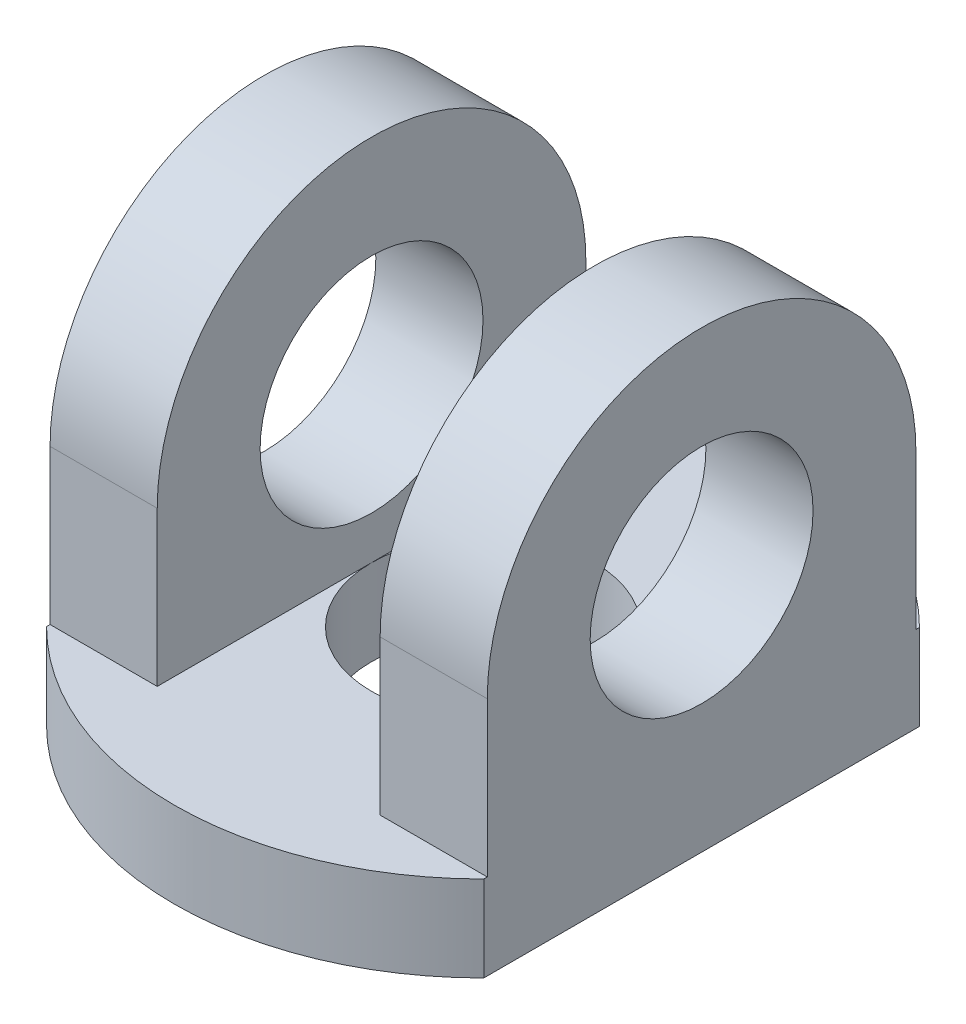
ISO-10303-21;
HEADER;
FILE_DESCRIPTION(('STEP AP214'),'2;1');
FILE_NAME('part.step','',(''),(''),'','','');
FILE_SCHEMA(('AUTOMOTIVE_DESIGN { 1 0 10303 214 1 1 1 1 }'));
ENDSEC;
DATA;
#1=APPLICATION_CONTEXT('core data for automotive mechanical design processes');
#2=APPLICATION_PROTOCOL_DEFINITION('international standard','automotive_design',2000,#1);
#3=PRODUCT_CONTEXT('',#1,'mechanical');
#4=PRODUCT('Part','Part','',(#3));
#5=PRODUCT_RELATED_PRODUCT_CATEGORY('part','',(#4));
#6=PRODUCT_DEFINITION_FORMATION('','',#4);
#7=PRODUCT_DEFINITION_CONTEXT('part definition',#1,'design');
#8=PRODUCT_DEFINITION('design','',#6,#7);
#9=PRODUCT_DEFINITION_SHAPE('','',#8);
#10=(LENGTH_UNIT() NAMED_UNIT(*) SI_UNIT(.MILLI.,.METRE.));
#11=(NAMED_UNIT(*) PLANE_ANGLE_UNIT() SI_UNIT($,.RADIAN.));
#12=(NAMED_UNIT(*) SI_UNIT($,.STERADIAN.) SOLID_ANGLE_UNIT());
#13=UNCERTAINTY_MEASURE_WITH_UNIT(LENGTH_MEASURE(1.E-05),#10,'distance_accuracy_value','');
#14=(GEOMETRIC_REPRESENTATION_CONTEXT(3) GLOBAL_UNCERTAINTY_ASSIGNED_CONTEXT((#13)) GLOBAL_UNIT_ASSIGNED_CONTEXT((#10,
#11,#12)) REPRESENTATION_CONTEXT('',''));
#15=CARTESIAN_POINT('',(0.,0.,0.));
#16=DIRECTION('',(0.,0.,1.));
#17=DIRECTION('',(1.,0.,0.));
#18=AXIS2_PLACEMENT_3D('',#15,#16,#17);
#19=CARTESIAN_POINT('',(0.,20.,0.));
#20=DIRECTION('',(0.,1.,0.));
#21=DIRECTION('',(0.,0.,1.));
#22=AXIS2_PLACEMENT_3D('',#19,#20,#21);
#23=PLANE('',#22);
#24=DIRECTION('',(0.,0.,1.));
#25=VECTOR('',#24,1.);
#26=CARTESIAN_POINT('',(51.,20.,-50.));
#27=LINE('',#26,#25);
#28=CARTESIAN_POINT('',(51.,20.,-50.8232230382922));
#29=VERTEX_POINT('',#28);
#30=CARTESIAN_POINT('',(51.,20.,-50.));
#31=VERTEX_POINT('',#30);
#32=EDGE_CURVE('E131',#29,#31,#27,.T.);
#33=ORIENTED_EDGE('',*,*,#32,.F.);
#34=CARTESIAN_POINT('',(0.,20.,0.));
#35=DIRECTION('',(0.,1.,0.));
#36=DIRECTION('',(0.,0.,1.));
#37=AXIS2_PLACEMENT_3D('',#34,#35,#36);
#38=CIRCLE('',#37,72.);
#39=CARTESIAN_POINT('',(-51.,20.,-50.8232230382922));
#40=VERTEX_POINT('',#39);
#41=EDGE_CURVE('E138',#29,#40,#38,.T.);
#42=ORIENTED_EDGE('',*,*,#41,.T.);
#43=DIRECTION('',(0.,0.,-1.));
#44=VECTOR('',#43,1.);
#45=CARTESIAN_POINT('',(-51.,20.,-50.));
#46=LINE('',#45,#44);
#47=CARTESIAN_POINT('',(-51.,20.,-50.));
#48=VERTEX_POINT('',#47);
#49=EDGE_CURVE('E135',#48,#40,#46,.T.);
#50=ORIENTED_EDGE('',*,*,#49,.F.);
#51=DIRECTION('',(1.,0.,0.));
#52=VECTOR('',#51,1.);
#53=CARTESIAN_POINT('',(-51.,20.,-50.));
#54=LINE('',#53,#52);
#55=CARTESIAN_POINT('',(-26.,20.,-50.));
#56=VERTEX_POINT('',#55);
#57=EDGE_CURVE('E238',#48,#56,#54,.T.);
#58=ORIENTED_EDGE('',*,*,#57,.T.);
#59=DIRECTION('',(0.,0.,1.));
#60=VECTOR('',#59,1.);
#61=CARTESIAN_POINT('',(-26.,20.,-72.));
#62=LINE('',#61,#60);
#63=CARTESIAN_POINT('',(-26.,20.,0.));
#64=VERTEX_POINT('',#63);
#65=EDGE_CURVE('E203',#56,#64,#62,.T.);
#66=ORIENTED_EDGE('',*,*,#65,.T.);
#67=CARTESIAN_POINT('',(0.,20.,0.));
#68=DIRECTION('',(0.,1.,0.));
#69=DIRECTION('',(0.,0.,1.));
#70=AXIS2_PLACEMENT_3D('',#67,#68,#69);
#71=CIRCLE('',#70,26.);
#72=CARTESIAN_POINT('',(26.,20.,0.));
#73=VERTEX_POINT('',#72);
#74=EDGE_CURVE('E45',#73,#64,#71,.T.);
#75=ORIENTED_EDGE('',*,*,#74,.F.);
#76=DIRECTION('',(0.,0.,1.));
#77=VECTOR('',#76,1.);
#78=CARTESIAN_POINT('',(26.,20.,-72.));
#79=LINE('',#78,#77);
#80=CARTESIAN_POINT('',(26.,20.,-50.));
#81=VERTEX_POINT('',#80);
#82=EDGE_CURVE('E52',#81,#73,#79,.T.);
#83=ORIENTED_EDGE('',*,*,#82,.F.);
#84=EDGE_CURVE('E141',#81,#31,#54,.T.);
#85=ORIENTED_EDGE('',*,*,#84,.T.);
#86=EDGE_LOOP('',(#33,#42,#50,#58,#66,#75,#83,#85));
#87=FACE_BOUND('',#86,.T.);
#88=ADVANCED_FACE('F31',(#87),#23,.T.);
#89=CARTESIAN_POINT('',(0.,20.,0.));
#90=DIRECTION('',(0.,-1.,0.));
#91=DIRECTION('',(0.,0.,-1.));
#92=AXIS2_PLACEMENT_3D('',#89,#90,#91);
#93=CYLINDRICAL_SURFACE('',#92,72.);
#94=ORIENTED_EDGE('',*,*,#41,.F.);
#95=DIRECTION('',(0.,-1.,0.));
#96=VECTOR('',#95,1.);
#97=CARTESIAN_POINT('',(51.,20.,-50.8232230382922));
#98=LINE('',#97,#96);
#99=CARTESIAN_POINT('',(51.,0.,-50.8232230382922));
#100=VERTEX_POINT('',#99);
#101=EDGE_CURVE('E126',#29,#100,#98,.T.);
#102=ORIENTED_EDGE('',*,*,#101,.T.);
#103=CARTESIAN_POINT('',(0.,0.,0.));
#104=DIRECTION('',(0.,1.,0.));
#105=DIRECTION('',(0.,0.,1.));
#106=AXIS2_PLACEMENT_3D('',#103,#104,#105);
#107=CIRCLE('',#106,72.);
#108=CARTESIAN_POINT('',(-51.,0.,-50.8232230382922));
#109=VERTEX_POINT('',#108);
#110=EDGE_CURVE('E155',#100,#109,#107,.T.);
#111=ORIENTED_EDGE('',*,*,#110,.T.);
#112=DIRECTION('',(0.,-1.,0.));
#113=VECTOR('',#112,1.);
#114=CARTESIAN_POINT('',(-51.,20.,-50.8232230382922));
#115=LINE('',#114,#113);
#116=EDGE_CURVE('E148',#109,#40,#115,.F.);
#117=ORIENTED_EDGE('',*,*,#116,.T.);
#118=EDGE_LOOP('',(#94,#102,#111,#117));
#119=FACE_BOUND('',#118,.T.);
#120=ADVANCED_FACE('F146',(#119),#93,.T.);
#121=CARTESIAN_POINT('',(-51.,20.,50.));
#122=DIRECTION('',(0.,0.,1.));
#123=DIRECTION('',(1.,0.,0.));
#124=AXIS2_PLACEMENT_3D('',#121,#122,#123);
#125=PLANE('',#124);
#126=DIRECTION('',(0.,-1.,0.));
#127=VECTOR('',#126,1.);
#128=CARTESIAN_POINT('',(-26.,20.,50.));
#129=LINE('',#128,#127);
#130=CARTESIAN_POINT('',(-26.,56.,50.));
#131=VERTEX_POINT('',#130);
#132=CARTESIAN_POINT('',(-26.,20.,50.));
#133=VERTEX_POINT('',#132);
#134=EDGE_CURVE('E211',#131,#133,#129,.T.);
#135=ORIENTED_EDGE('',*,*,#134,.F.);
#136=DIRECTION('',(1.,0.,0.));
#137=VECTOR('',#136,1.);
#138=CARTESIAN_POINT('',(-51.,56.,50.));
#139=LINE('',#138,#137);
#140=CARTESIAN_POINT('',(-51.,56.,50.));
#141=VERTEX_POINT('',#140);
#142=EDGE_CURVE('E231',#141,#131,#139,.T.);
#143=ORIENTED_EDGE('',*,*,#142,.F.);
#144=DIRECTION('',(0.,-1.,0.));
#145=VECTOR('',#144,1.);
#146=CARTESIAN_POINT('',(-51.,20.,50.));
#147=LINE('',#146,#145);
#148=CARTESIAN_POINT('',(-51.,20.,50.));
#149=VERTEX_POINT('',#148);
#150=EDGE_CURVE('E221',#141,#149,#147,.T.);
#151=ORIENTED_EDGE('',*,*,#150,.T.);
#152=DIRECTION('',(1.,0.,0.));
#153=VECTOR('',#152,1.);
#154=CARTESIAN_POINT('',(-51.,20.,50.));
#155=LINE('',#154,#153);
#156=EDGE_CURVE('E158',#149,#133,#155,.T.);
#157=ORIENTED_EDGE('',*,*,#156,.T.);
#158=EDGE_LOOP('',(#135,#143,#151,#157));
#159=FACE_BOUND('',#158,.T.);
#160=ADVANCED_FACE('F284',(#159),#125,.T.);
#161=CARTESIAN_POINT('',(-51.,56.,0.));
#162=DIRECTION('',(1.,0.,0.));
#163=DIRECTION('',(0.,0.,-1.));
#164=AXIS2_PLACEMENT_3D('',#161,#162,#163);
#165=CYLINDRICAL_SURFACE('',#164,50.);
#166=CARTESIAN_POINT('',(-26.,56.,0.));
#167=DIRECTION('',(-1.,0.,0.));
#168=DIRECTION('',(0.,-1.,0.));
#169=AXIS2_PLACEMENT_3D('',#166,#167,#168);
#170=CIRCLE('',#169,50.);
#171=CARTESIAN_POINT('',(-26.,56.,-50.));
#172=VERTEX_POINT('',#171);
#173=EDGE_CURVE('E209',#172,#131,#170,.F.);
#174=ORIENTED_EDGE('',*,*,#173,.F.);
#175=DIRECTION('',(1.,0.,0.));
#176=VECTOR('',#175,1.);
#177=CARTESIAN_POINT('',(-51.,56.,-50.));
#178=LINE('',#177,#176);
#179=CARTESIAN_POINT('',(-51.,56.,-50.));
#180=VERTEX_POINT('',#179);
#181=EDGE_CURVE('E235',#180,#172,#178,.T.);
#182=ORIENTED_EDGE('',*,*,#181,.F.);
#183=CARTESIAN_POINT('',(-51.,56.,0.));
#184=DIRECTION('',(1.,0.,0.));
#185=DIRECTION('',(0.,0.,-1.));
#186=AXIS2_PLACEMENT_3D('',#183,#184,#185);
#187=CIRCLE('',#186,50.);
#188=EDGE_CURVE('E227',#180,#141,#187,.T.);
#189=ORIENTED_EDGE('',*,*,#188,.T.);
#190=ORIENTED_EDGE('',*,*,#142,.T.);
#191=EDGE_LOOP('',(#174,#182,#189,#190));
#192=FACE_BOUND('',#191,.T.);
#193=ADVANCED_FACE('F274',(#192),#165,.T.);
#194=CARTESIAN_POINT('',(-51.,20.,-50.));
#195=DIRECTION('',(0.,0.,-1.));
#196=DIRECTION('',(-1.,0.,0.));
#197=AXIS2_PLACEMENT_3D('',#194,#195,#196);
#198=PLANE('',#197);
#199=DIRECTION('',(0.,1.,0.));
#200=VECTOR('',#199,1.);
#201=CARTESIAN_POINT('',(-26.,20.,-50.));
#202=LINE('',#201,#200);
#203=EDGE_CURVE('E162',#56,#172,#202,.T.);
#204=ORIENTED_EDGE('',*,*,#203,.F.);
#205=ORIENTED_EDGE('',*,*,#57,.F.);
#206=DIRECTION('',(0.,1.,0.));
#207=VECTOR('',#206,1.);
#208=CARTESIAN_POINT('',(-51.,20.,-50.));
#209=LINE('',#208,#207);
#210=EDGE_CURVE('E224',#48,#180,#209,.T.);
#211=ORIENTED_EDGE('',*,*,#210,.T.);
#212=ORIENTED_EDGE('',*,*,#181,.T.);
#213=EDGE_LOOP('',(#204,#205,#211,#212));
#214=FACE_BOUND('',#213,.T.);
#215=ADVANCED_FACE('F266',(#214),#198,.T.);
#216=CARTESIAN_POINT('',(51.,20.,50.));
#217=VERTEX_POINT('',#216);
#218=CARTESIAN_POINT('',(51.,20.,50.8232230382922));
#219=VERTEX_POINT('',#218);
#220=EDGE_CURVE('E143',#217,#219,#27,.T.);
#221=ORIENTED_EDGE('',*,*,#220,.F.);
#222=CARTESIAN_POINT('',(26.,20.,50.));
#223=VERTEX_POINT('',#222);
#224=EDGE_CURVE('E230',#223,#217,#155,.T.);
#225=ORIENTED_EDGE('',*,*,#224,.F.);
#226=EDGE_CURVE('E202',#73,#223,#79,.T.);
#227=ORIENTED_EDGE('',*,*,#226,.F.);
#228=EDGE_CURVE('E185',#64,#73,#71,.T.);
#229=ORIENTED_EDGE('',*,*,#228,.F.);
#230=EDGE_CURVE('E199',#64,#133,#62,.T.);
#231=ORIENTED_EDGE('',*,*,#230,.T.);
#232=ORIENTED_EDGE('',*,*,#156,.F.);
#233=CARTESIAN_POINT('',(-51.,20.,50.8232230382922));
#234=VERTEX_POINT('',#233);
#235=EDGE_CURVE('E188',#234,#149,#46,.T.);
#236=ORIENTED_EDGE('',*,*,#235,.F.);
#237=EDGE_CURVE('E149',#234,#219,#38,.T.);
#238=ORIENTED_EDGE('',*,*,#237,.T.);
#239=EDGE_LOOP('',(#221,#225,#227,#229,#231,#232,#236,#238));
#240=FACE_BOUND('',#239,.T.);
#241=ADVANCED_FACE('F277',(#240),#23,.T.);
#242=CARTESIAN_POINT('',(-51.,0.,50.8232230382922));
#243=VERTEX_POINT('',#242);
#244=CARTESIAN_POINT('',(51.,0.,50.8232230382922));
#245=VERTEX_POINT('',#244);
#246=EDGE_CURVE('E150',#243,#245,#107,.T.);
#247=ORIENTED_EDGE('',*,*,#246,.T.);
#248=DIRECTION('',(0.,-1.,0.));
#249=VECTOR('',#248,1.);
#250=CARTESIAN_POINT('',(51.,20.,50.8232230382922));
#251=LINE('',#250,#249);
#252=EDGE_CURVE('E136',#245,#219,#251,.F.);
#253=ORIENTED_EDGE('',*,*,#252,.T.);
#254=ORIENTED_EDGE('',*,*,#237,.F.);
#255=DIRECTION('',(0.,-1.,0.));
#256=VECTOR('',#255,1.);
#257=CARTESIAN_POINT('',(-51.,20.,50.8232230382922));
#258=LINE('',#257,#256);
#259=EDGE_CURVE('E180',#234,#243,#258,.T.);
#260=ORIENTED_EDGE('',*,*,#259,.T.);
#261=EDGE_LOOP('',(#247,#253,#254,#260));
#262=FACE_BOUND('',#261,.T.);
#263=ADVANCED_FACE('F33',(#262),#93,.T.);
#264=CARTESIAN_POINT('',(0.,0.,0.));
#265=DIRECTION('',(0.,1.,0.));
#266=DIRECTION('',(0.,0.,1.));
#267=AXIS2_PLACEMENT_3D('',#264,#265,#266);
#268=PLANE('',#267);
#269=CARTESIAN_POINT('',(0.,0.,0.));
#270=DIRECTION('',(0.,1.,0.));
#271=DIRECTION('',(0.,0.,1.));
#272=AXIS2_PLACEMENT_3D('',#269,#270,#271);
#273=CIRCLE('',#272,26.);
#274=CARTESIAN_POINT('',(0.,0.,26.));
#275=VERTEX_POINT('',#274);
#276=EDGE_CURVE('E170',#275,#275,#273,.T.);
#277=ORIENTED_EDGE('',*,*,#276,.T.);
#278=EDGE_LOOP('',(#277));
#279=FACE_BOUND('',#278,.T.);
#280=ORIENTED_EDGE('',*,*,#110,.F.);
#281=DIRECTION('',(0.,0.,1.));
#282=VECTOR('',#281,1.);
#283=CARTESIAN_POINT('',(51.,0.,0.));
#284=LINE('',#283,#282);
#285=EDGE_CURVE('E11',#100,#245,#284,.T.);
#286=ORIENTED_EDGE('',*,*,#285,.T.);
#287=ORIENTED_EDGE('',*,*,#246,.F.);
#288=DIRECTION('',(0.,0.,-1.));
#289=VECTOR('',#288,1.);
#290=CARTESIAN_POINT('',(-51.,0.,0.));
#291=LINE('',#290,#289);
#292=EDGE_CURVE('E39',#243,#109,#291,.T.);
#293=ORIENTED_EDGE('',*,*,#292,.T.);
#294=EDGE_LOOP('',(#280,#286,#287,#293));
#295=FACE_BOUND('',#294,.T.);
#296=ADVANCED_FACE('F175',(#279,#295),#268,.F.);
#297=DIRECTION('',(0.,1.,0.));
#298=VECTOR('',#297,1.);
#299=CARTESIAN_POINT('',(26.,20.,50.));
#300=LINE('',#299,#298);
#301=CARTESIAN_POINT('',(26.,56.,50.));
#302=VERTEX_POINT('',#301);
#303=EDGE_CURVE('E207',#223,#302,#300,.T.);
#304=ORIENTED_EDGE('',*,*,#303,.F.);
#305=ORIENTED_EDGE('',*,*,#224,.T.);
#306=DIRECTION('',(0.,-1.,0.));
#307=VECTOR('',#306,1.);
#308=CARTESIAN_POINT('',(51.,20.,50.));
#309=LINE('',#308,#307);
#310=CARTESIAN_POINT('',(51.,56.,50.));
#311=VERTEX_POINT('',#310);
#312=EDGE_CURVE('E214',#311,#217,#309,.T.);
#313=ORIENTED_EDGE('',*,*,#312,.F.);
#314=EDGE_CURVE('E234',#302,#311,#139,.T.);
#315=ORIENTED_EDGE('',*,*,#314,.F.);
#316=EDGE_LOOP('',(#304,#305,#313,#315));
#317=FACE_BOUND('',#316,.T.);
#318=ADVANCED_FACE('F250',(#317),#125,.T.);
#319=CARTESIAN_POINT('',(26.,56.,-50.));
#320=VERTEX_POINT('',#319);
#321=CARTESIAN_POINT('',(51.,56.,-50.));
#322=VERTEX_POINT('',#321);
#323=EDGE_CURVE('E237',#320,#322,#178,.T.);
#324=ORIENTED_EDGE('',*,*,#323,.F.);
#325=CARTESIAN_POINT('',(26.,56.,0.));
#326=DIRECTION('',(1.,0.,0.));
#327=DIRECTION('',(0.,1.,0.));
#328=AXIS2_PLACEMENT_3D('',#325,#326,#327);
#329=CIRCLE('',#328,50.);
#330=EDGE_CURVE('E201',#302,#320,#329,.F.);
#331=ORIENTED_EDGE('',*,*,#330,.F.);
#332=ORIENTED_EDGE('',*,*,#314,.T.);
#333=CARTESIAN_POINT('',(51.,56.,0.));
#334=DIRECTION('',(1.,0.,0.));
#335=DIRECTION('',(0.,0.,-1.));
#336=AXIS2_PLACEMENT_3D('',#333,#334,#335);
#337=CIRCLE('',#336,50.);
#338=EDGE_CURVE('E218',#322,#311,#337,.T.);
#339=ORIENTED_EDGE('',*,*,#338,.F.);
#340=EDGE_LOOP('',(#324,#331,#332,#339));
#341=FACE_BOUND('',#340,.T.);
#342=ADVANCED_FACE('F257',(#341),#165,.T.);
#343=DIRECTION('',(0.,-1.,0.));
#344=VECTOR('',#343,1.);
#345=CARTESIAN_POINT('',(26.,20.,-50.));
#346=LINE('',#345,#344);
#347=EDGE_CURVE('E153',#320,#81,#346,.T.);
#348=ORIENTED_EDGE('',*,*,#347,.F.);
#349=ORIENTED_EDGE('',*,*,#323,.T.);
#350=DIRECTION('',(0.,1.,0.));
#351=VECTOR('',#350,1.);
#352=CARTESIAN_POINT('',(51.,20.,-50.));
#353=LINE('',#352,#351);
#354=EDGE_CURVE('E216',#31,#322,#353,.T.);
#355=ORIENTED_EDGE('',*,*,#354,.F.);
#356=ORIENTED_EDGE('',*,*,#84,.F.);
#357=EDGE_LOOP('',(#348,#349,#355,#356));
#358=FACE_BOUND('',#357,.T.);
#359=ADVANCED_FACE('F263',(#358),#198,.T.);
#360=CARTESIAN_POINT('',(-51.,56.,0.));
#361=DIRECTION('',(1.,0.,0.));
#362=DIRECTION('',(0.,0.,-1.));
#363=AXIS2_PLACEMENT_3D('',#360,#361,#362);
#364=PLANE('',#363);
#365=CARTESIAN_POINT('',(-51.,56.,0.));
#366=DIRECTION('',(-1.,0.,0.));
#367=DIRECTION('',(0.,0.,1.));
#368=AXIS2_PLACEMENT_3D('',#365,#366,#367);
#369=CIRCLE('',#368,26.);
#370=CARTESIAN_POINT('',(-51.,56.,26.));
#371=VERTEX_POINT('',#370);
#372=EDGE_CURVE('E169',#371,#371,#369,.T.);
#373=ORIENTED_EDGE('',*,*,#372,.F.);
#374=EDGE_LOOP('',(#373));
#375=FACE_BOUND('',#374,.T.);
#376=ORIENTED_EDGE('',*,*,#150,.F.);
#377=ORIENTED_EDGE('',*,*,#188,.F.);
#378=ORIENTED_EDGE('',*,*,#210,.F.);
#379=ORIENTED_EDGE('',*,*,#49,.T.);
#380=ORIENTED_EDGE('',*,*,#116,.F.);
#381=ORIENTED_EDGE('',*,*,#292,.F.);
#382=ORIENTED_EDGE('',*,*,#259,.F.);
#383=ORIENTED_EDGE('',*,*,#235,.T.);
#384=EDGE_LOOP('',(#376,#377,#378,#379,#380,#381,#382,#383));
#385=FACE_BOUND('',#384,.T.);
#386=ADVANCED_FACE('F179',(#375,#385),#364,.F.);
#387=CARTESIAN_POINT('',(51.,56.,0.));
#388=DIRECTION('',(1.,0.,0.));
#389=DIRECTION('',(0.,0.,-1.));
#390=AXIS2_PLACEMENT_3D('',#387,#388,#389);
#391=PLANE('',#390);
#392=CARTESIAN_POINT('',(51.,56.,0.));
#393=DIRECTION('',(1.,0.,0.));
#394=DIRECTION('',(0.,0.,-1.));
#395=AXIS2_PLACEMENT_3D('',#392,#393,#394);
#396=CIRCLE('',#395,26.);
#397=CARTESIAN_POINT('',(51.,56.,-26.));
#398=VERTEX_POINT('',#397);
#399=EDGE_CURVE('E196',#398,#398,#396,.T.);
#400=ORIENTED_EDGE('',*,*,#399,.F.);
#401=EDGE_LOOP('',(#400));
#402=FACE_BOUND('',#401,.T.);
#403=ORIENTED_EDGE('',*,*,#312,.T.);
#404=ORIENTED_EDGE('',*,*,#220,.T.);
#405=ORIENTED_EDGE('',*,*,#252,.F.);
#406=ORIENTED_EDGE('',*,*,#285,.F.);
#407=ORIENTED_EDGE('',*,*,#101,.F.);
#408=ORIENTED_EDGE('',*,*,#32,.T.);
#409=ORIENTED_EDGE('',*,*,#354,.T.);
#410=ORIENTED_EDGE('',*,*,#338,.T.);
#411=EDGE_LOOP('',(#403,#404,#405,#406,#407,#408,#409,#410));
#412=FACE_BOUND('',#411,.T.);
#413=ADVANCED_FACE('F129',(#402,#412),#391,.T.);
#414=CARTESIAN_POINT('',(-26.,106.,-72.));
#415=DIRECTION('',(-1.,0.,0.));
#416=DIRECTION('',(0.,-1.,0.));
#417=AXIS2_PLACEMENT_3D('',#414,#415,#416);
#418=PLANE('',#417);
#419=CARTESIAN_POINT('',(-26.,56.,0.));
#420=DIRECTION('',(-1.,0.,0.));
#421=DIRECTION('',(0.,-1.,0.));
#422=AXIS2_PLACEMENT_3D('',#419,#420,#421);
#423=CIRCLE('',#422,26.);
#424=CARTESIAN_POINT('',(-26.,30.,0.));
#425=VERTEX_POINT('',#424);
#426=EDGE_CURVE('E168',#425,#425,#423,.T.);
#427=ORIENTED_EDGE('',*,*,#426,.T.);
#428=EDGE_LOOP('',(#427));
#429=FACE_BOUND('',#428,.T.);
#430=ORIENTED_EDGE('',*,*,#134,.T.);
#431=ORIENTED_EDGE('',*,*,#230,.F.);
#432=ORIENTED_EDGE('',*,*,#65,.F.);
#433=ORIENTED_EDGE('',*,*,#203,.T.);
#434=ORIENTED_EDGE('',*,*,#173,.T.);
#435=EDGE_LOOP('',(#430,#431,#432,#433,#434));
#436=FACE_BOUND('',#435,.T.);
#437=ADVANCED_FACE('F296',(#429,#436),#418,.F.);
#438=CARTESIAN_POINT('',(26.,106.,-72.));
#439=DIRECTION('',(1.,0.,0.));
#440=DIRECTION('',(0.,1.,0.));
#441=AXIS2_PLACEMENT_3D('',#438,#439,#440);
#442=PLANE('',#441);
#443=CARTESIAN_POINT('',(26.,56.,0.));
#444=DIRECTION('',(1.,0.,0.));
#445=DIRECTION('',(0.,1.,0.));
#446=AXIS2_PLACEMENT_3D('',#443,#444,#445);
#447=CIRCLE('',#446,26.);
#448=CARTESIAN_POINT('',(26.,82.,0.));
#449=VERTEX_POINT('',#448);
#450=EDGE_CURVE('E165',#449,#449,#447,.T.);
#451=ORIENTED_EDGE('',*,*,#450,.T.);
#452=EDGE_LOOP('',(#451));
#453=FACE_BOUND('',#452,.T.);
#454=ORIENTED_EDGE('',*,*,#303,.T.);
#455=ORIENTED_EDGE('',*,*,#330,.T.);
#456=ORIENTED_EDGE('',*,*,#347,.T.);
#457=ORIENTED_EDGE('',*,*,#82,.T.);
#458=ORIENTED_EDGE('',*,*,#226,.T.);
#459=EDGE_LOOP('',(#454,#455,#456,#457,#458));
#460=FACE_BOUND('',#459,.T.);
#461=ADVANCED_FACE('F261',(#453,#460),#442,.F.);
#462=CARTESIAN_POINT('',(72.,56.,0.));
#463=DIRECTION('',(-1.,0.,0.));
#464=DIRECTION('',(0.,0.,1.));
#465=AXIS2_PLACEMENT_3D('',#462,#463,#464);
#466=CYLINDRICAL_SURFACE('',#465,26.);
#467=ORIENTED_EDGE('',*,*,#399,.T.);
#468=EDGE_LOOP('',(#467));
#469=FACE_BOUND('',#468,.T.);
#470=ORIENTED_EDGE('',*,*,#450,.F.);
#471=EDGE_LOOP('',(#470));
#472=FACE_BOUND('',#471,.T.);
#473=ADVANCED_FACE('F325',(#469,#472),#466,.F.);
#474=ORIENTED_EDGE('',*,*,#372,.T.);
#475=EDGE_LOOP('',(#474));
#476=FACE_BOUND('',#475,.T.);
#477=ORIENTED_EDGE('',*,*,#426,.F.);
#478=EDGE_LOOP('',(#477));
#479=FACE_BOUND('',#478,.T.);
#480=ADVANCED_FACE('F300',(#476,#479),#466,.F.);
#481=CARTESIAN_POINT('',(0.,-82.,0.));
#482=DIRECTION('',(0.,1.,0.));
#483=DIRECTION('',(0.,0.,1.));
#484=AXIS2_PLACEMENT_3D('',#481,#482,#483);
#485=CYLINDRICAL_SURFACE('',#484,26.);
#486=ORIENTED_EDGE('',*,*,#74,.T.);
#487=ORIENTED_EDGE('',*,*,#228,.T.);
#488=EDGE_LOOP('',(#486,#487));
#489=FACE_BOUND('',#488,.T.);
#490=ORIENTED_EDGE('',*,*,#276,.F.);
#491=EDGE_LOOP('',(#490));
#492=FACE_BOUND('',#491,.T.);
#493=ADVANCED_FACE('F297',(#489,#492),#485,.F.);
#494=CLOSED_SHELL('',(#88,#120,#160,#193,#215,#241,#263,#296,#318,#342,#359,#386,#413,#437,#461,
#473,#480,#493));
#495=MANIFOLD_SOLID_BREP('B2',#494);
#496=ADVANCED_BREP_SHAPE_REPRESENTATION('',(#18,#495),#14);
#497=SHAPE_DEFINITION_REPRESENTATION(#9,#496);
ENDSEC;
END-ISO-10303-21;
